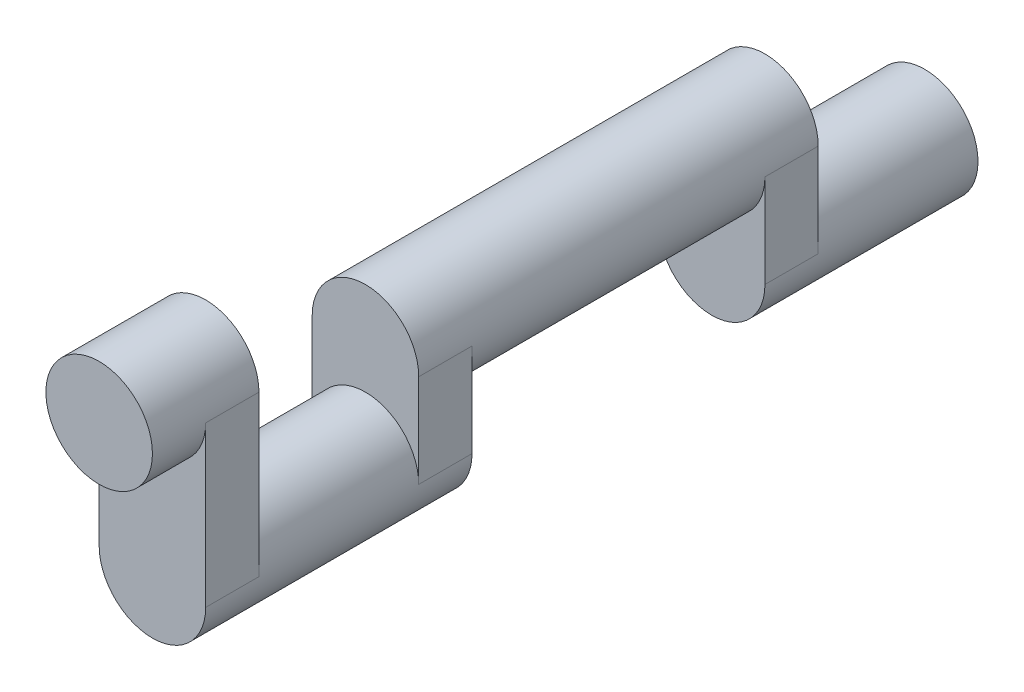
from build123d import *
from build123d.topology import SkipClean

# Parameters (mm, degrees)
SKETCH1_R             = 25.4
EXTRUDE1_DEPTH        = 25.4
LARGE_OFFSET_DEPTH    = 25.4
SKETCH3_R             = 25.4
SHORT_CYLINDER1_DEPTH = 76.2
SMALL_OFFSET1_DEPTH   = 25.4
SKETCH5_R             = 25.4
LONG_CYLINDER_DEPTH   = 190.5
SMALL_START           = -25.4
SMALL_OFFSET2_DEPTH   = 25.4
SKETCH7_R             = 25.4
SHORT_CYLINDER2_DEPTH = 76.2


with BuildPart() as part:
    # Sketch1 → Extrude1 (new body)
    with BuildSketch(Plane.XY):
        Circle(SKETCH1_R)
    extrude(amount=-EXTRUDE1_DEPTH)

    # Sketch2 → large offset (add)
    with SkipClean():  # the faces are left unmerged after this step: merging them gives an invalid solid
        with BuildSketch(Plane(origin=(0, 0, -25.4), x_dir=(-1, 0, 0), z_dir=(0, 0, -1))):
            with BuildLine():
                Line((-25.4, 0), (-25.4, -76.2))
                ThreePointArc((-25.4, -76.2), (0, -101.6), (25.4, -76.2))
                Line((25.4, -76.2), (25.4, 0))
                ThreePointArc((25.4, 0), (0, 25.4), (-25.4, 0))
            make_face()
        extrude(amount=LARGE_OFFSET_DEPTH)

    # Sketch3 → short cylinder1 (add)
    with SkipClean():  # the faces are left unmerged after this step: merging them gives an invalid solid
        with BuildSketch(Plane(origin=(0, 0, -50.8), x_dir=(-1, 0, 0), z_dir=(0, 0, -1))):
            with Locations((0, -76.2)):
                Circle(SKETCH3_R)
        extrude(amount=SHORT_CYLINDER1_DEPTH)

    # Sketch4 → small offset1 (add)
    with SkipClean():  # the faces are left unmerged after this step: merging them gives an invalid solid
        with BuildSketch(Plane(origin=(0, 0, -127), x_dir=(-1, 0, 0), z_dir=(0, 0, -1))):
            with BuildLine():
                Line((-25.4, -76.2), (-25.4, -31.75))
                ThreePointArc((-25.4, -31.75), (0, -6.35), (25.4, -31.75))
                Line((25.4, -31.75), (25.4, -76.2))
                ThreePointArc((25.4, -76.2), (0, -101.6), (-25.4, -76.2))
            make_face()
        extrude(amount=SMALL_OFFSET1_DEPTH)

    # Sketch5 → long cylinder (add)
    with SkipClean():  # the faces are left unmerged after this step: merging them gives an invalid solid
        with BuildSketch(Plane(origin=(0, 0, -127), x_dir=(-1, 0, 0), z_dir=(0, 0, -1))):
            with Locations((0, -31.75)):
                Circle(SKETCH5_R)
        extrude(amount=LONG_CYLINDER_DEPTH)

    # Sketch6 → small offset2 (add)
    with SkipClean():  # the faces are left unmerged after this step: merging them gives an invalid solid
        with BuildSketch(Plane(origin=(0, 0, -317.5), x_dir=(-1, 0, 0), z_dir=(0, 0, -1)).offset(SMALL_START)):
            with BuildLine():
                Line((25.4, -31.75), (25.4, -76.2))
                ThreePointArc((25.4, -76.2), (0, -101.6), (-25.4, -76.2))
                Line((-25.4, -76.2), (-25.4, -31.75))
                ThreePointArc((-25.4, -31.75), (0, -6.35), (25.4, -31.75))
            make_face()
        extrude(amount=SMALL_OFFSET2_DEPTH)

    # Sketch7 → short cylinder2 (add)
    with SkipClean():  # the faces are left unmerged after this step: merging them gives an invalid solid
        with BuildSketch(Plane.XY.offset(-317.5)):
            with Locations((0, -76.2)):
                Circle(SKETCH7_R)
        extrude(amount=-SHORT_CYLINDER2_DEPTH)


solid = part.part
